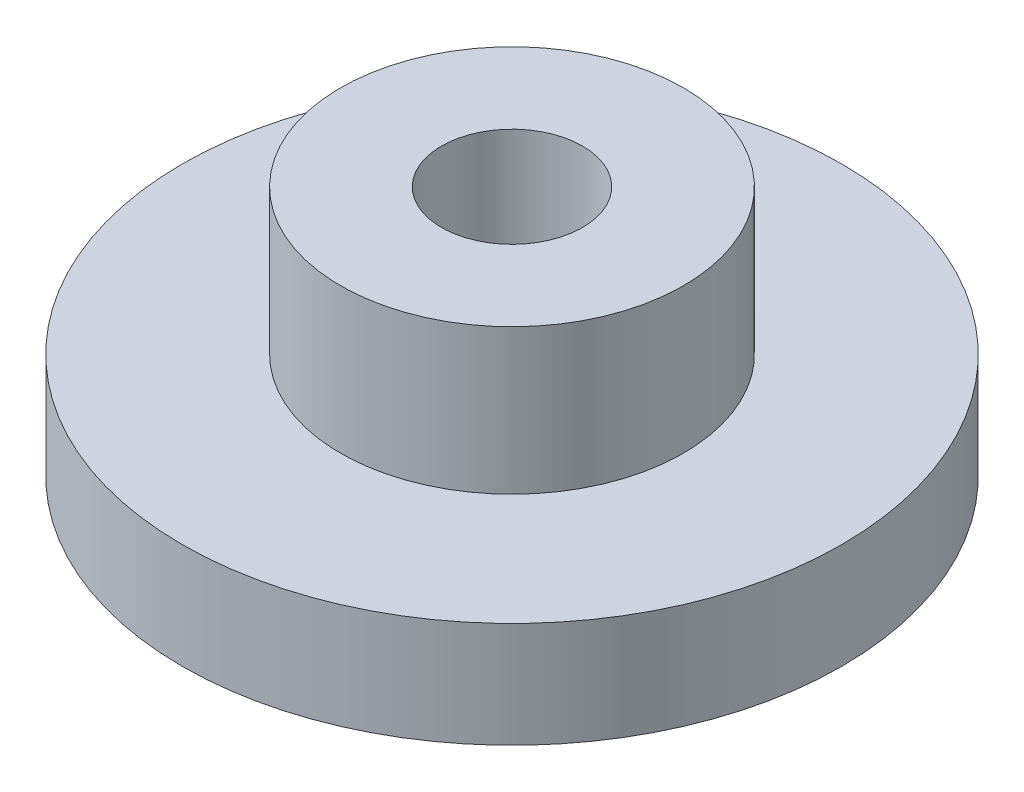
ISO-10303-21;
HEADER;
FILE_DESCRIPTION(('STEP AP214'),'2;1');
FILE_NAME('part.step','',(''),(''),'','','');
FILE_SCHEMA(('AUTOMOTIVE_DESIGN { 1 0 10303 214 1 1 1 1 }'));
ENDSEC;
DATA;
#1=APPLICATION_CONTEXT('core data for automotive mechanical design processes');
#2=APPLICATION_PROTOCOL_DEFINITION('international standard','automotive_design',2000,#1);
#3=PRODUCT_CONTEXT('',#1,'mechanical');
#4=PRODUCT('Part','Part','',(#3));
#5=PRODUCT_RELATED_PRODUCT_CATEGORY('part','',(#4));
#6=PRODUCT_DEFINITION_FORMATION('','',#4);
#7=PRODUCT_DEFINITION_CONTEXT('part definition',#1,'design');
#8=PRODUCT_DEFINITION('design','',#6,#7);
#9=PRODUCT_DEFINITION_SHAPE('','',#8);
#10=(LENGTH_UNIT() NAMED_UNIT(*) SI_UNIT(.MILLI.,.METRE.));
#11=(NAMED_UNIT(*) PLANE_ANGLE_UNIT() SI_UNIT($,.RADIAN.));
#12=(NAMED_UNIT(*) SI_UNIT($,.STERADIAN.) SOLID_ANGLE_UNIT());
#13=UNCERTAINTY_MEASURE_WITH_UNIT(LENGTH_MEASURE(1.E-05),#10,'distance_accuracy_value','');
#14=(GEOMETRIC_REPRESENTATION_CONTEXT(3) GLOBAL_UNCERTAINTY_ASSIGNED_CONTEXT((#13)) GLOBAL_UNIT_ASSIGNED_CONTEXT((#10,
#11,#12)) REPRESENTATION_CONTEXT('',''));
#15=CARTESIAN_POINT('',(0.,0.,0.));
#16=DIRECTION('',(0.,0.,1.));
#17=DIRECTION('',(1.,0.,0.));
#18=AXIS2_PLACEMENT_3D('',#15,#16,#17);
#19=CARTESIAN_POINT('',(0.,0.,0.));
#20=DIRECTION('',(0.,-1.,0.));
#21=DIRECTION('',(0.,0.,-1.));
#22=AXIS2_PLACEMENT_3D('',#19,#20,#21);
#23=CYLINDRICAL_SURFACE('',#22,6.5);
#24=CARTESIAN_POINT('',(0.,0.,0.));
#25=DIRECTION('',(0.,-1.,0.));
#26=DIRECTION('',(0.,0.,-1.));
#27=AXIS2_PLACEMENT_3D('',#24,#25,#26);
#28=CIRCLE('',#27,6.5);
#29=CARTESIAN_POINT('',(0.,0.,-6.5));
#30=VERTEX_POINT('',#29);
#31=EDGE_CURVE('E45',#30,#30,#28,.T.);
#32=ORIENTED_EDGE('',*,*,#31,.T.);
#33=EDGE_LOOP('',(#32));
#34=FACE_BOUND('',#33,.T.);
#35=CARTESIAN_POINT('',(0.,-5.5,0.));
#36=DIRECTION('',(0.,-1.,0.));
#37=DIRECTION('',(0.,0.,-1.));
#38=AXIS2_PLACEMENT_3D('',#35,#36,#37);
#39=CIRCLE('',#38,6.5);
#40=CARTESIAN_POINT('',(0.,-5.5,-6.5));
#41=VERTEX_POINT('',#40);
#42=EDGE_CURVE('E60',#41,#41,#39,.T.);
#43=ORIENTED_EDGE('',*,*,#42,.F.);
#44=EDGE_LOOP('',(#43));
#45=FACE_BOUND('',#44,.T.);
#46=ADVANCED_FACE('F34',(#34,#45),#23,.T.);
#47=CARTESIAN_POINT('',(2.675,0.,0.));
#48=DIRECTION('',(0.,1.,0.));
#49=DIRECTION('',(0.,0.,1.));
#50=AXIS2_PLACEMENT_3D('',#47,#48,#49);
#51=PLANE('',#50);
#52=CARTESIAN_POINT('',(0.,0.,0.));
#53=DIRECTION('',(0.,-1.,0.));
#54=DIRECTION('',(0.,0.,-1.));
#55=AXIS2_PLACEMENT_3D('',#52,#53,#54);
#56=CIRCLE('',#55,2.675);
#57=CARTESIAN_POINT('',(0.,0.,-2.675));
#58=VERTEX_POINT('',#57);
#59=EDGE_CURVE('E49',#58,#58,#56,.T.);
#60=ORIENTED_EDGE('',*,*,#59,.T.);
#61=EDGE_LOOP('',(#60));
#62=FACE_BOUND('',#61,.T.);
#63=ORIENTED_EDGE('',*,*,#31,.F.);
#64=EDGE_LOOP('',(#63));
#65=FACE_BOUND('',#64,.T.);
#66=ADVANCED_FACE('F68',(#62,#65),#51,.T.);
#67=CARTESIAN_POINT('',(0.,0.,0.));
#68=DIRECTION('',(0.,-1.,0.));
#69=DIRECTION('',(0.,0.,-1.));
#70=AXIS2_PLACEMENT_3D('',#67,#68,#69);
#71=CYLINDRICAL_SURFACE('',#70,2.675);
#72=CARTESIAN_POINT('',(0.,-6.5,0.));
#73=DIRECTION('',(0.,-1.,0.));
#74=DIRECTION('',(0.,0.,-1.));
#75=AXIS2_PLACEMENT_3D('',#72,#73,#74);
#76=CIRCLE('',#75,2.675);
#77=CARTESIAN_POINT('',(0.,-6.5,-2.675));
#78=VERTEX_POINT('',#77);
#79=EDGE_CURVE('E41',#78,#78,#76,.T.);
#80=ORIENTED_EDGE('',*,*,#79,.T.);
#81=EDGE_LOOP('',(#80));
#82=FACE_BOUND('',#81,.T.);
#83=ORIENTED_EDGE('',*,*,#59,.F.);
#84=EDGE_LOOP('',(#83));
#85=FACE_BOUND('',#84,.T.);
#86=ADVANCED_FACE('F73',(#82,#85),#71,.F.);
#87=CARTESIAN_POINT('',(12.5,-9.5,0.));
#88=DIRECTION('',(0.,-1.,0.));
#89=DIRECTION('',(0.,0.,-1.));
#90=AXIS2_PLACEMENT_3D('',#87,#88,#89);
#91=PLANE('',#90);
#92=CARTESIAN_POINT('',(0.,-9.5,0.));
#93=DIRECTION('',(0.,-1.,0.));
#94=DIRECTION('',(0.,0.,-1.));
#95=AXIS2_PLACEMENT_3D('',#92,#93,#94);
#96=CIRCLE('',#95,5.67500000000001);
#97=CARTESIAN_POINT('',(0.,-9.5,-5.67500000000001));
#98=VERTEX_POINT('',#97);
#99=EDGE_CURVE('E10',#98,#98,#96,.F.);
#100=ORIENTED_EDGE('',*,*,#99,.T.);
#101=EDGE_LOOP('',(#100));
#102=FACE_BOUND('',#101,.T.);
#103=CARTESIAN_POINT('',(0.,-9.5,0.));
#104=DIRECTION('',(0.,-1.,0.));
#105=DIRECTION('',(0.,0.,-1.));
#106=AXIS2_PLACEMENT_3D('',#103,#104,#105);
#107=CIRCLE('',#106,12.5);
#108=CARTESIAN_POINT('',(0.,-9.5,-12.5));
#109=VERTEX_POINT('',#108);
#110=EDGE_CURVE('E54',#109,#109,#107,.T.);
#111=ORIENTED_EDGE('',*,*,#110,.T.);
#112=EDGE_LOOP('',(#111));
#113=FACE_BOUND('',#112,.T.);
#114=ADVANCED_FACE('F79',(#102,#113),#91,.T.);
#115=CARTESIAN_POINT('',(0.,0.,0.));
#116=DIRECTION('',(0.,-1.,0.));
#117=DIRECTION('',(0.,0.,-1.));
#118=AXIS2_PLACEMENT_3D('',#115,#116,#117);
#119=CYLINDRICAL_SURFACE('',#118,12.5);
#120=CARTESIAN_POINT('',(0.,-5.5,0.));
#121=DIRECTION('',(0.,-1.,0.));
#122=DIRECTION('',(0.,0.,-1.));
#123=AXIS2_PLACEMENT_3D('',#120,#121,#122);
#124=CIRCLE('',#123,12.5);
#125=CARTESIAN_POINT('',(0.,-5.5,-12.5));
#126=VERTEX_POINT('',#125);
#127=EDGE_CURVE('E57',#126,#126,#124,.T.);
#128=ORIENTED_EDGE('',*,*,#127,.T.);
#129=EDGE_LOOP('',(#128));
#130=FACE_BOUND('',#129,.T.);
#131=ORIENTED_EDGE('',*,*,#110,.F.);
#132=EDGE_LOOP('',(#131));
#133=FACE_BOUND('',#132,.T.);
#134=ADVANCED_FACE('F82',(#130,#133),#119,.T.);
#135=CARTESIAN_POINT('',(6.5,-5.5,0.));
#136=DIRECTION('',(0.,1.,0.));
#137=DIRECTION('',(0.,0.,1.));
#138=AXIS2_PLACEMENT_3D('',#135,#136,#137);
#139=PLANE('',#138);
#140=ORIENTED_EDGE('',*,*,#42,.T.);
#141=EDGE_LOOP('',(#140));
#142=FACE_BOUND('',#141,.T.);
#143=ORIENTED_EDGE('',*,*,#127,.F.);
#144=EDGE_LOOP('',(#143));
#145=FACE_BOUND('',#144,.T.);
#146=ADVANCED_FACE('F64',(#142,#145),#139,.T.);
#147=CARTESIAN_POINT('',(0.,-6.5,0.));
#148=DIRECTION('',(0.,-1.,0.));
#149=DIRECTION('',(0.,0.,-1.));
#150=AXIS2_PLACEMENT_3D('',#147,#148,#149);
#151=CONICAL_SURFACE('',#150,2.675,0.78539816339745);
#152=ORIENTED_EDGE('',*,*,#99,.F.);
#153=EDGE_LOOP('',(#152));
#154=FACE_BOUND('',#153,.T.);
#155=ORIENTED_EDGE('',*,*,#79,.F.);
#156=EDGE_LOOP('',(#155));
#157=FACE_BOUND('',#156,.T.);
#158=ADVANCED_FACE('F36',(#154,#157),#151,.F.);
#159=CLOSED_SHELL('',(#46,#66,#86,#114,#134,#146,#158));
#160=MANIFOLD_SOLID_BREP('B2',#159);
#161=ADVANCED_BREP_SHAPE_REPRESENTATION('',(#18,#160),#14);
#162=SHAPE_DEFINITION_REPRESENTATION(#9,#161);
ENDSEC;
END-ISO-10303-21;
